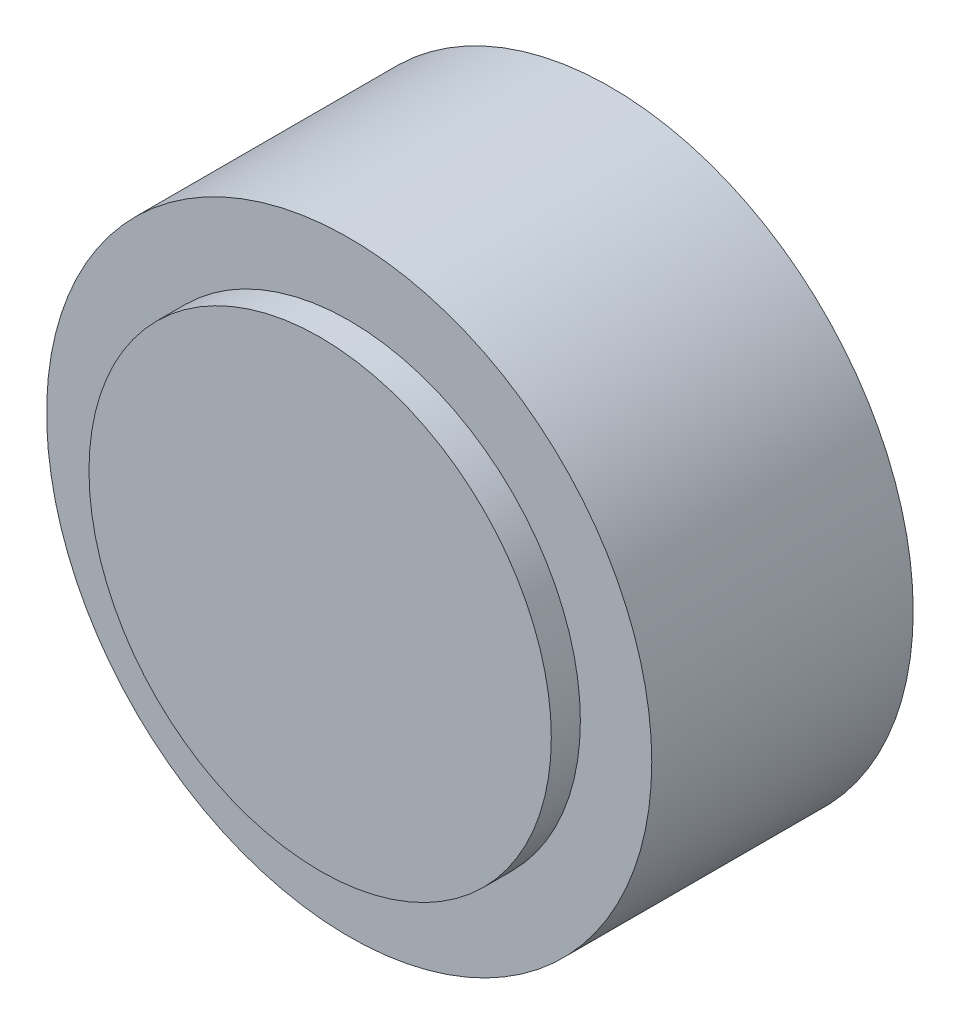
ISO-10303-21;
HEADER;
FILE_DESCRIPTION(('STEP AP214'),'2;1');
FILE_NAME('part.step','',(''),(''),'','','');
FILE_SCHEMA(('AUTOMOTIVE_DESIGN { 1 0 10303 214 1 1 1 1 }'));
ENDSEC;
DATA;
#1=APPLICATION_CONTEXT('core data for automotive mechanical design processes');
#2=APPLICATION_PROTOCOL_DEFINITION('international standard','automotive_design',2000,#1);
#3=PRODUCT_CONTEXT('',#1,'mechanical');
#4=PRODUCT('Part','Part','',(#3));
#5=PRODUCT_RELATED_PRODUCT_CATEGORY('part','',(#4));
#6=PRODUCT_DEFINITION_FORMATION('','',#4);
#7=PRODUCT_DEFINITION_CONTEXT('part definition',#1,'design');
#8=PRODUCT_DEFINITION('design','',#6,#7);
#9=PRODUCT_DEFINITION_SHAPE('','',#8);
#10=(LENGTH_UNIT() NAMED_UNIT(*) SI_UNIT(.MILLI.,.METRE.));
#11=(NAMED_UNIT(*) PLANE_ANGLE_UNIT() SI_UNIT($,.RADIAN.));
#12=(NAMED_UNIT(*) SI_UNIT($,.STERADIAN.) SOLID_ANGLE_UNIT());
#13=UNCERTAINTY_MEASURE_WITH_UNIT(LENGTH_MEASURE(1.E-05),#10,'distance_accuracy_value','');
#14=(GEOMETRIC_REPRESENTATION_CONTEXT(3) GLOBAL_UNCERTAINTY_ASSIGNED_CONTEXT((#13)) GLOBAL_UNIT_ASSIGNED_CONTEXT((#10,
#11,#12)) REPRESENTATION_CONTEXT('',''));
#15=CARTESIAN_POINT('',(0.,0.,0.));
#16=DIRECTION('',(0.,0.,1.));
#17=DIRECTION('',(1.,0.,0.));
#18=AXIS2_PLACEMENT_3D('',#15,#16,#17);
#19=CARTESIAN_POINT('',(0.,0.,32.));
#20=DIRECTION('',(0.,0.,1.));
#21=DIRECTION('',(1.,0.,0.));
#22=AXIS2_PLACEMENT_3D('',#19,#20,#21);
#23=CYLINDRICAL_SURFACE('',#22,12.5);
#24=CARTESIAN_POINT('',(0.,0.,0.));
#25=DIRECTION('',(0.,0.,1.));
#26=DIRECTION('',(1.,0.,0.));
#27=AXIS2_PLACEMENT_3D('',#24,#25,#26);
#28=CIRCLE('',#27,12.5);
#29=CARTESIAN_POINT('',(12.5,0.,0.));
#30=VERTEX_POINT('',#29);
#31=EDGE_CURVE('E19',#30,#30,#28,.T.);
#32=ORIENTED_EDGE('',*,*,#31,.T.);
#33=EDGE_LOOP('',(#32));
#34=FACE_BOUND('',#33,.T.);
#35=CARTESIAN_POINT('',(0.,0.,10.8));
#36=DIRECTION('',(0.,0.,1.));
#37=DIRECTION('',(1.,0.,0.));
#38=AXIS2_PLACEMENT_3D('',#35,#36,#37);
#39=CIRCLE('',#38,12.5);
#40=CARTESIAN_POINT('',(12.5,0.,10.8));
#41=VERTEX_POINT('',#40);
#42=EDGE_CURVE('E28',#41,#41,#39,.T.);
#43=ORIENTED_EDGE('',*,*,#42,.F.);
#44=EDGE_LOOP('',(#43));
#45=FACE_BOUND('',#44,.T.);
#46=ADVANCED_FACE('F12',(#34,#45),#23,.T.);
#47=CARTESIAN_POINT('',(0.,0.,32.));
#48=DIRECTION('',(0.,0.,1.));
#49=DIRECTION('',(1.,0.,0.));
#50=AXIS2_PLACEMENT_3D('',#47,#48,#49);
#51=CYLINDRICAL_SURFACE('',#50,3.);
#52=CARTESIAN_POINT('',(0.,0.,7.8));
#53=DIRECTION('',(0.,0.,-1.));
#54=DIRECTION('',(-1.,0.,0.));
#55=AXIS2_PLACEMENT_3D('',#52,#53,#54);
#56=CIRCLE('',#55,3.);
#57=CARTESIAN_POINT('',(-3.,0.,7.8));
#58=VERTEX_POINT('',#57);
#59=EDGE_CURVE('E31',#58,#58,#56,.T.);
#60=ORIENTED_EDGE('',*,*,#59,.F.);
#61=EDGE_LOOP('',(#60));
#62=FACE_BOUND('',#61,.T.);
#63=CARTESIAN_POINT('',(0.,0.,0.));
#64=DIRECTION('',(0.,0.,1.));
#65=DIRECTION('',(1.,0.,0.));
#66=AXIS2_PLACEMENT_3D('',#63,#64,#65);
#67=CIRCLE('',#66,3.);
#68=CARTESIAN_POINT('',(3.,0.,0.));
#69=VERTEX_POINT('',#68);
#70=EDGE_CURVE('E8',#69,#69,#67,.T.);
#71=ORIENTED_EDGE('',*,*,#70,.F.);
#72=EDGE_LOOP('',(#71));
#73=FACE_BOUND('',#72,.T.);
#74=ADVANCED_FACE('F37',(#62,#73),#51,.F.);
#75=CARTESIAN_POINT('',(3.,0.,0.));
#76=DIRECTION('',(0.,0.,1.));
#77=DIRECTION('',(1.,0.,0.));
#78=AXIS2_PLACEMENT_3D('',#75,#76,#77);
#79=PLANE('',#78);
#80=ORIENTED_EDGE('',*,*,#31,.F.);
#81=EDGE_LOOP('',(#80));
#82=FACE_BOUND('',#81,.T.);
#83=ORIENTED_EDGE('',*,*,#70,.T.);
#84=EDGE_LOOP('',(#83));
#85=FACE_BOUND('',#84,.T.);
#86=ADVANCED_FACE('F40',(#82,#85),#79,.F.);
#87=CARTESIAN_POINT('',(0.,0.,20.));
#88=DIRECTION('',(0.,0.,1.));
#89=DIRECTION('',(1.,0.,0.));
#90=AXIS2_PLACEMENT_3D('',#87,#88,#89);
#91=CYLINDRICAL_SURFACE('',#90,9.55);
#92=CARTESIAN_POINT('',(0.,0.,10.8));
#93=DIRECTION('',(0.,0.,1.));
#94=DIRECTION('',(1.,0.,0.));
#95=AXIS2_PLACEMENT_3D('',#92,#93,#94);
#96=CIRCLE('',#95,9.55);
#97=CARTESIAN_POINT('',(9.55,0.,10.8));
#98=VERTEX_POINT('',#97);
#99=EDGE_CURVE('E25',#98,#98,#96,.T.);
#100=ORIENTED_EDGE('',*,*,#99,.T.);
#101=EDGE_LOOP('',(#100));
#102=FACE_BOUND('',#101,.T.);
#103=CARTESIAN_POINT('',(0.,0.,12.));
#104=DIRECTION('',(0.,0.,-1.));
#105=DIRECTION('',(-1.,0.,0.));
#106=AXIS2_PLACEMENT_3D('',#103,#104,#105);
#107=CIRCLE('',#106,9.55);
#108=CARTESIAN_POINT('',(-9.55,0.,12.));
#109=VERTEX_POINT('',#108);
#110=EDGE_CURVE('E15',#109,#109,#107,.T.);
#111=ORIENTED_EDGE('',*,*,#110,.T.);
#112=EDGE_LOOP('',(#111));
#113=FACE_BOUND('',#112,.T.);
#114=ADVANCED_FACE('F48',(#102,#113),#91,.T.);
#115=CARTESIAN_POINT('',(-9.55,0.,10.8));
#116=DIRECTION('',(0.,0.,1.));
#117=DIRECTION('',(1.,0.,0.));
#118=AXIS2_PLACEMENT_3D('',#115,#116,#117);
#119=PLANE('',#118);
#120=ORIENTED_EDGE('',*,*,#42,.T.);
#121=EDGE_LOOP('',(#120));
#122=FACE_BOUND('',#121,.T.);
#123=ORIENTED_EDGE('',*,*,#99,.F.);
#124=EDGE_LOOP('',(#123));
#125=FACE_BOUND('',#124,.T.);
#126=ADVANCED_FACE('F55',(#122,#125),#119,.T.);
#127=CARTESIAN_POINT('',(12.5,0.,12.));
#128=DIRECTION('',(0.,0.,-1.));
#129=DIRECTION('',(-1.,0.,0.));
#130=AXIS2_PLACEMENT_3D('',#127,#128,#129);
#131=PLANE('',#130);
#132=ORIENTED_EDGE('',*,*,#110,.F.);
#133=EDGE_LOOP('',(#132));
#134=FACE_BOUND('',#133,.T.);
#135=ADVANCED_FACE('F53',(#134),#131,.F.);
#136=CARTESIAN_POINT('',(0.,0.,7.8));
#137=DIRECTION('',(0.,0.,-1.));
#138=DIRECTION('',(-1.,0.,0.));
#139=AXIS2_PLACEMENT_3D('',#136,#137,#138);
#140=PLANE('',#139);
#141=ORIENTED_EDGE('',*,*,#59,.T.);
#142=EDGE_LOOP('',(#141));
#143=FACE_BOUND('',#142,.T.);
#144=ADVANCED_FACE('F35',(#143),#140,.T.);
#145=CLOSED_SHELL('',(#46,#74,#86,#114,#126,#135,#144));
#146=MANIFOLD_SOLID_BREP('B1',#145);
#147=ADVANCED_BREP_SHAPE_REPRESENTATION('',(#18,#146),#14);
#148=SHAPE_DEFINITION_REPRESENTATION(#9,#147);
ENDSEC;
END-ISO-10303-21;
